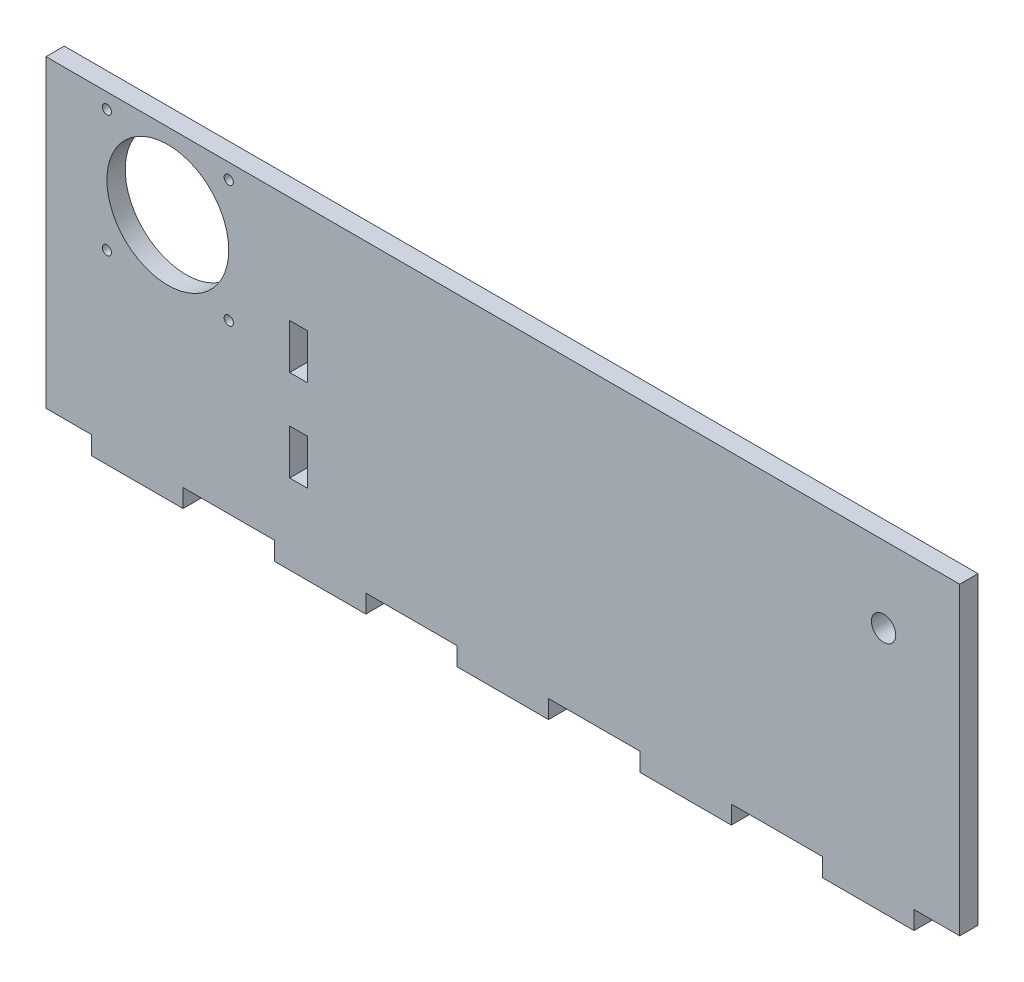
from build123d import *

# Parameters (mm, degrees)
BOSS_EXTRUDE1_DEPTH = 6
CUT_EXTRUDE2_REACH  = 162.225
SKETCH2_R           = 20
SKETCH2_R_2         = 1.5
SKETCH2_R_3         = 4
SKETCH2_W           = 5.8
SKETCH2_H           = 14.8


with BuildPart() as part:
    # Sketch1 → Boss-Extrude1 (new body)
    with BuildSketch(Plane.XY):
        Polygon((-75, -56), (-45, -56), (-45, -50), (-15, -50), (-15, -56), (15, -56), (15, -50), (45, -50), (45, -56), (75, -56), (75, -50), (105, -50), (105, -56), (135, -56), (135, -50), (150, -50), (150, 50), (-150, 50), (-150, -50), (-135, -50), (-135, -56), (-105, -56), (-105, -50), (-75, -50), align=None)
    extrude(amount=BOSS_EXTRUDE1_DEPTH)

    # Sketch2 → Cut-Extrude2 (cut, up to next)
    with BuildSketch(Plane.XY.offset(6), mode=Mode.PRIVATE) as cut_extrude2_sk1:
        with Locations((-110, 25)):
            Circle(SKETCH2_R)
    cut_extrude2_tool1 = extrude(cut_extrude2_sk1.sketch, amount=-CUT_EXTRUDE2_REACH, mode=Mode.PRIVATE) & part.part
    # Sketch2 → Cut-Extrude2 (cut, up to next)
    with BuildSketch(Plane.XY.offset(6), mode=Mode.PRIVATE) as cut_extrude2_sk2:
        with Locations((-130, 45)):
            Circle(SKETCH2_R_2)
    cut_extrude2_tool2 = extrude(cut_extrude2_sk2.sketch, amount=-CUT_EXTRUDE2_REACH, mode=Mode.PRIVATE) & part.part
    # Sketch2 → Cut-Extrude2 (cut, up to next)
    with BuildSketch(Plane.XY.offset(6), mode=Mode.PRIVATE) as cut_extrude2_sk3:
        with Locations((-90, 45)):
            Circle(SKETCH2_R_2)
    cut_extrude2_tool3 = extrude(cut_extrude2_sk3.sketch, amount=-CUT_EXTRUDE2_REACH, mode=Mode.PRIVATE) & part.part
    # Sketch2 → Cut-Extrude2 (cut, up to next)
    with BuildSketch(Plane.XY.offset(6), mode=Mode.PRIVATE) as cut_extrude2_sk4:
        with Locations((-90, 5)):
            Circle(SKETCH2_R_2)
    cut_extrude2_tool4 = extrude(cut_extrude2_sk4.sketch, amount=-CUT_EXTRUDE2_REACH, mode=Mode.PRIVATE) & part.part
    # Sketch2 → Cut-Extrude2 (cut, up to next)
    with BuildSketch(Plane.XY.offset(6), mode=Mode.PRIVATE) as cut_extrude2_sk5:
        with Locations((-130, 5)):
            Circle(SKETCH2_R_2)
    cut_extrude2_tool5 = extrude(cut_extrude2_sk5.sketch, amount=-CUT_EXTRUDE2_REACH, mode=Mode.PRIVATE) & part.part
    # Sketch2 → Cut-Extrude2 (cut, up to next)
    with BuildSketch(Plane.XY.offset(6), mode=Mode.PRIVATE) as cut_extrude2_sk6:
        with Locations((125, 25)):
            Circle(SKETCH2_R_3)
    cut_extrude2_tool6 = extrude(cut_extrude2_sk6.sketch, amount=-CUT_EXTRUDE2_REACH, mode=Mode.PRIVATE) & part.part
    # Sketch2 → Cut-Extrude2 (cut, up to next)
    with BuildSketch(Plane.XY.offset(6), mode=Mode.PRIVATE) as cut_extrude2_sk7:
        with Locations((-67.1, 7.6)):
            Rectangle(SKETCH2_W, SKETCH2_H)
    cut_extrude2_tool7 = extrude(cut_extrude2_sk7.sketch, amount=-CUT_EXTRUDE2_REACH, mode=Mode.PRIVATE) & part.part
    # Sketch2 → Cut-Extrude2 (cut, up to next)
    with BuildSketch(Plane.XY.offset(6), mode=Mode.PRIVATE) as cut_extrude2_sk8:
        with Locations((-67.1, -22.4)):
            Rectangle(SKETCH2_W, SKETCH2_H)
    cut_extrude2_tool8 = extrude(cut_extrude2_sk8.sketch, amount=-CUT_EXTRUDE2_REACH, mode=Mode.PRIVATE) & part.part
    add(cut_extrude2_tool1.solids().sort_by_distance((-110, 25, 6))[0], mode=Mode.SUBTRACT)
    add(cut_extrude2_tool2.solids().sort_by_distance((-130, 45, 6))[0], mode=Mode.SUBTRACT)
    add(cut_extrude2_tool3.solids().sort_by_distance((-90, 45, 6))[0], mode=Mode.SUBTRACT)
    add(cut_extrude2_tool4.solids().sort_by_distance((-90, 5, 6))[0], mode=Mode.SUBTRACT)
    add(cut_extrude2_tool5.solids().sort_by_distance((-130, 5, 6))[0], mode=Mode.SUBTRACT)
    add(cut_extrude2_tool6.solids().sort_by_distance((125, 25, 6))[0], mode=Mode.SUBTRACT)
    add(cut_extrude2_tool7.solids().sort_by_distance((-67.1, 7.6, 6))[0], mode=Mode.SUBTRACT)
    add(cut_extrude2_tool8.solids().sort_by_distance((-67.1, -22.4, 6))[0], mode=Mode.SUBTRACT)


solid = part.part
